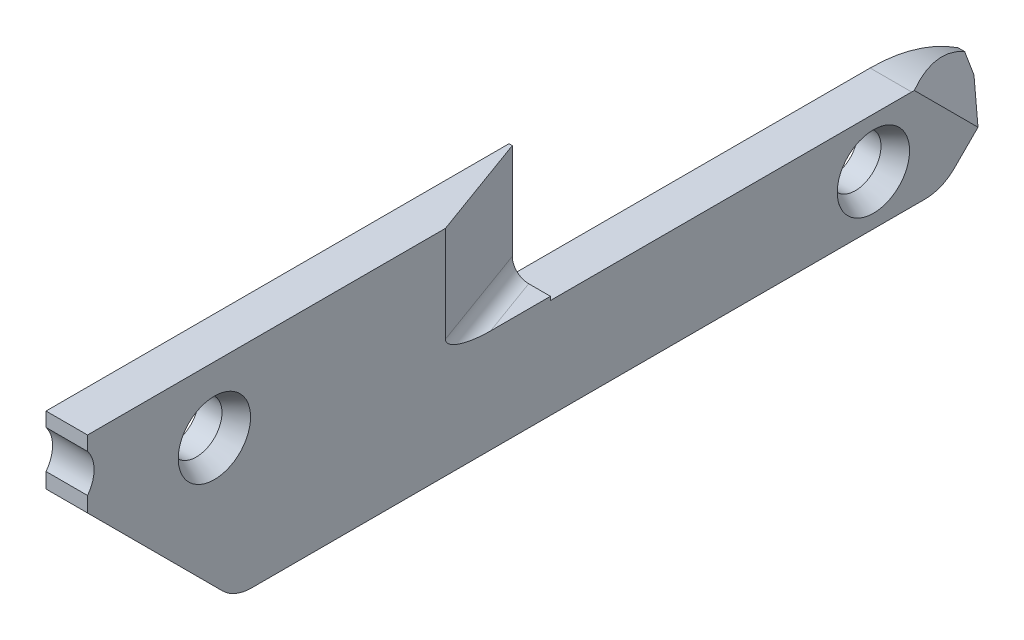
ISO-10303-21;
HEADER;
FILE_DESCRIPTION(('STEP AP214'),'2;1');
FILE_NAME('part.step','',(''),(''),'','','');
FILE_SCHEMA(('AUTOMOTIVE_DESIGN { 1 0 10303 214 1 1 1 1 }'));
ENDSEC;
DATA;
#1=APPLICATION_CONTEXT('core data for automotive mechanical design processes');
#2=APPLICATION_PROTOCOL_DEFINITION('international standard','automotive_design',2000,#1);
#3=PRODUCT_CONTEXT('',#1,'mechanical');
#4=PRODUCT('Part','Part','',(#3));
#5=PRODUCT_RELATED_PRODUCT_CATEGORY('part','',(#4));
#6=PRODUCT_DEFINITION_FORMATION('','',#4);
#7=PRODUCT_DEFINITION_CONTEXT('part definition',#1,'design');
#8=PRODUCT_DEFINITION('design','',#6,#7);
#9=PRODUCT_DEFINITION_SHAPE('','',#8);
#10=(LENGTH_UNIT() NAMED_UNIT(*) SI_UNIT(.MILLI.,.METRE.));
#11=(NAMED_UNIT(*) PLANE_ANGLE_UNIT() SI_UNIT($,.RADIAN.));
#12=(NAMED_UNIT(*) SI_UNIT($,.STERADIAN.) SOLID_ANGLE_UNIT());
#13=UNCERTAINTY_MEASURE_WITH_UNIT(LENGTH_MEASURE(1.E-05),#10,'distance_accuracy_value','');
#14=(GEOMETRIC_REPRESENTATION_CONTEXT(3) GLOBAL_UNCERTAINTY_ASSIGNED_CONTEXT((#13)) GLOBAL_UNIT_ASSIGNED_CONTEXT((#10,
#11,#12)) REPRESENTATION_CONTEXT('',''));
#15=CARTESIAN_POINT('',(0.,0.,0.));
#16=DIRECTION('',(0.,0.,1.));
#17=DIRECTION('',(1.,0.,0.));
#18=AXIS2_PLACEMENT_3D('',#15,#16,#17);
#19=CARTESIAN_POINT('',(3.2004,-16.0782,-53.7464));
#20=DIRECTION('',(1.,0.,0.));
#21=DIRECTION('',(0.,0.,-1.));
#22=AXIS2_PLACEMENT_3D('',#19,#20,#21);
#23=PLANE('',#22);
#24=CARTESIAN_POINT('',(3.2004,-7.62,-50.8));
#25=DIRECTION('',(1.,0.,0.));
#26=DIRECTION('',(0.,0.,-1.));
#27=AXIS2_PLACEMENT_3D('',#24,#25,#26);
#28=CIRCLE('',#27,2.7877583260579);
#29=CARTESIAN_POINT('',(3.2004,-7.62,-53.5877583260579));
#30=VERTEX_POINT('',#29);
#31=EDGE_CURVE('E45',#30,#30,#28,.F.);
#32=ORIENTED_EDGE('',*,*,#31,.T.);
#33=EDGE_LOOP('',(#32));
#34=FACE_BOUND('',#33,.T.);
#35=CARTESIAN_POINT('',(3.2004,0.,0.));
#36=DIRECTION('',(1.,0.,0.));
#37=DIRECTION('',(0.,0.,-1.));
#38=AXIS2_PLACEMENT_3D('',#35,#36,#37);
#39=CIRCLE('',#38,2.7877583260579);
#40=CARTESIAN_POINT('',(3.2004,0.,-2.7877583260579));
#41=VERTEX_POINT('',#40);
#42=EDGE_CURVE('E279',#41,#41,#39,.F.);
#43=ORIENTED_EDGE('',*,*,#42,.T.);
#44=EDGE_LOOP('',(#43));
#45=FACE_BOUND('',#44,.T.);
#46=DIRECTION('',(0.,0.,1.));
#47=VECTOR('',#46,1.);
#48=CARTESIAN_POINT('',(3.2004,-3.5052,-17.8128325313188));
#49=LINE('',#48,#47);
#50=CARTESIAN_POINT('',(3.2004,-3.5052,-25.908));
#51=VERTEX_POINT('',#50);
#52=CARTESIAN_POINT('',(3.2004,-3.5052,-21.293987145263));
#53=VERTEX_POINT('',#52);
#54=EDGE_CURVE('E322',#51,#53,#49,.T.);
#55=ORIENTED_EDGE('',*,*,#54,.T.);
#56=CARTESIAN_POINT('',(3.2004,-2.314575,-21.293987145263));
#57=DIRECTION('',(1.,0.,0.));
#58=DIRECTION('',(0.,0.,-1.));
#59=AXIS2_PLACEMENT_3D('',#56,#57,#58);
#60=ELLIPSE('',#59,3.48115461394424,1.190625);
#61=CARTESIAN_POINT('',(3.2004,-2.314575,-17.8128325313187));
#62=VERTEX_POINT('',#61);
#63=EDGE_CURVE('E162',#53,#62,#60,.F.);
#64=ORIENTED_EDGE('',*,*,#63,.T.);
#65=DIRECTION('',(0.,1.,0.));
#66=VECTOR('',#65,1.);
#67=CARTESIAN_POINT('',(3.2004,-20.0700972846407,-17.8128325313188));
#68=LINE('',#67,#66);
#69=CARTESIAN_POINT('',(3.2004,5.08,-17.8128325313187));
#70=VERTEX_POINT('',#69);
#71=EDGE_CURVE('E156',#62,#70,#68,.T.);
#72=ORIENTED_EDGE('',*,*,#71,.T.);
#73=DIRECTION('',(0.,0.,1.));
#74=VECTOR('',#73,1.);
#75=CARTESIAN_POINT('',(3.2004,5.08,-25.908));
#76=LINE('',#75,#74);
#77=CARTESIAN_POINT('',(3.2004,5.07999999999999,9.779));
#78=VERTEX_POINT('',#77);
#79=EDGE_CURVE('E159',#70,#78,#76,.T.);
#80=ORIENTED_EDGE('',*,*,#79,.T.);
#81=DIRECTION('',(0.,-1.,0.));
#82=VECTOR('',#81,1.);
#83=CARTESIAN_POINT('',(3.2004,5.07999999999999,9.779));
#84=LINE('',#83,#82);
#85=CARTESIAN_POINT('',(3.2004,3.98473128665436,9.779));
#86=VERTEX_POINT('',#85);
#87=EDGE_CURVE('E178',#78,#86,#84,.T.);
#88=ORIENTED_EDGE('',*,*,#87,.T.);
#89=CARTESIAN_POINT('',(3.2004,2.5146,11.65225));
#90=DIRECTION('',(-1.,0.,0.));
#91=DIRECTION('',(0.,0.,-1.));
#92=AXIS2_PLACEMENT_3D('',#89,#90,#91);
#93=CIRCLE('',#92,2.38125);
#94=CARTESIAN_POINT('',(3.2004,1.04446871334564,9.779));
#95=VERTEX_POINT('',#94);
#96=EDGE_CURVE('E181',#86,#95,#93,.T.);
#97=ORIENTED_EDGE('',*,*,#96,.T.);
#98=DIRECTION('',(0.,-1.,0.));
#99=VECTOR('',#98,1.);
#100=CARTESIAN_POINT('',(3.2004,1.04446871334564,9.779));
#101=LINE('',#100,#99);
#102=CARTESIAN_POINT('',(3.2004,-0.127,9.779));
#103=VERTEX_POINT('',#102);
#104=EDGE_CURVE('E189',#95,#103,#101,.T.);
#105=ORIENTED_EDGE('',*,*,#104,.T.);
#106=DIRECTION('',(0.,-0.707106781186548,-0.707106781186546));
#107=VECTOR('',#106,1.);
#108=CARTESIAN_POINT('',(3.2004,-0.127,9.779));
#109=LINE('',#108,#107);
#110=CARTESIAN_POINT('',(3.2004,-10.5254640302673,-0.619464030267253));
#111=VERTEX_POINT('',#110);
#112=EDGE_CURVE('E191',#103,#111,#109,.T.);
#113=ORIENTED_EDGE('',*,*,#112,.T.);
#114=CARTESIAN_POINT('',(3.2004,-8.2804,-2.86452806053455));
#115=DIRECTION('',(1.,0.,0.));
#116=DIRECTION('',(0.,0.,-1.));
#117=AXIS2_PLACEMENT_3D('',#114,#115,#116);
#118=CIRCLE('',#117,3.175);
#119=CARTESIAN_POINT('',(3.2004,-11.4554,-2.86452806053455));
#120=VERTEX_POINT('',#119);
#121=EDGE_CURVE('E193',#111,#120,#118,.T.);
#122=ORIENTED_EDGE('',*,*,#121,.T.);
#123=DIRECTION('',(0.,0.,-1.));
#124=VECTOR('',#123,1.);
#125=CARTESIAN_POINT('',(3.2004,-11.4554,-2.86452806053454));
#126=LINE('',#125,#124);
#127=CARTESIAN_POINT('',(3.2004,-11.4554,-54.7878));
#128=VERTEX_POINT('',#127);
#129=EDGE_CURVE('E195',#120,#128,#126,.T.);
#130=ORIENTED_EDGE('',*,*,#129,.T.);
#131=CARTESIAN_POINT('',(3.2004,-8.2804,-54.7878));
#132=DIRECTION('',(1.,0.,0.));
#133=DIRECTION('',(0.,0.,-1.));
#134=AXIS2_PLACEMENT_3D('',#131,#132,#133);
#135=CIRCLE('',#134,3.175);
#136=CARTESIAN_POINT('',(3.2004,-10.5254640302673,-57.0328640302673));
#137=VERTEX_POINT('',#136);
#138=EDGE_CURVE('E197',#128,#137,#135,.T.);
#139=ORIENTED_EDGE('',*,*,#138,.T.);
#140=DIRECTION('',(0.,0.707106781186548,-0.707106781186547));
#141=VECTOR('',#140,1.);
#142=CARTESIAN_POINT('',(3.2004,-10.5254640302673,-57.0328640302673));
#143=LINE('',#142,#141);
#144=CARTESIAN_POINT('',(3.2004,-8.6961567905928,-58.8621712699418));
#145=VERTEX_POINT('',#144);
#146=EDGE_CURVE('E199',#137,#145,#143,.T.);
#147=ORIENTED_EDGE('',*,*,#146,.T.);
#148=DIRECTION('',(0.,-0.707106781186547,-0.707106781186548));
#149=VECTOR('',#148,1.);
#150=CARTESIAN_POINT('',(3.2004,32.5125072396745,-17.6535072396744));
#151=LINE('',#150,#149);
#152=CARTESIAN_POINT('',(3.2004,-3.78632504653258,-53.9523395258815));
#153=VERTEX_POINT('',#152);
#154=EDGE_CURVE('E307',#153,#145,#151,.T.);
#155=ORIENTED_EDGE('',*,*,#154,.F.);
#156=CARTESIAN_POINT('',(3.2004,-16.0782,-53.7464));
#157=DIRECTION('',(1.,0.,0.));
#158=DIRECTION('',(0.,0.,-1.));
#159=AXIS2_PLACEMENT_3D('',#156,#157,#158);
#160=CIRCLE('',#159,12.2936);
#161=CARTESIAN_POINT('',(3.2004,-3.7846,-53.7464));
#162=VERTEX_POINT('',#161);
#163=EDGE_CURVE('E234',#153,#162,#160,.T.);
#164=ORIENTED_EDGE('',*,*,#163,.T.);
#165=DIRECTION('',(0.,0.,1.));
#166=VECTOR('',#165,1.);
#167=CARTESIAN_POINT('',(3.2004,-3.7846,-53.7464));
#168=LINE('',#167,#166);
#169=CARTESIAN_POINT('',(3.2004,-3.7846,-25.908));
#170=VERTEX_POINT('',#169);
#171=EDGE_CURVE('E184',#162,#170,#168,.T.);
#172=ORIENTED_EDGE('',*,*,#171,.T.);
#173=DIRECTION('',(0.,1.,0.));
#174=VECTOR('',#173,1.);
#175=CARTESIAN_POINT('',(3.2004,-3.7846,-25.908));
#176=LINE('',#175,#174);
#177=EDGE_CURVE('E179',#170,#51,#176,.T.);
#178=ORIENTED_EDGE('',*,*,#177,.T.);
#179=EDGE_LOOP('',(#55,#64,#72,#80,#88,#97,#105,#113,#122,#130,#139,#147,#155,#164,#172,#178));
#180=FACE_BOUND('',#179,.T.);
#181=ADVANCED_FACE('F37',(#34,#45,#180),#23,.T.);
#182=CARTESIAN_POINT('',(0.,-16.0782,-53.7464));
#183=DIRECTION('',(1.,0.,0.));
#184=DIRECTION('',(0.,0.,-1.));
#185=AXIS2_PLACEMENT_3D('',#182,#183,#184);
#186=PLANE('',#185);
#187=CARTESIAN_POINT('',(0.,0.,0.));
#188=DIRECTION('',(1.,0.,0.));
#189=DIRECTION('',(0.,0.,-1.));
#190=AXIS2_PLACEMENT_3D('',#187,#188,#189);
#191=CIRCLE('',#190,1.9812);
#192=CARTESIAN_POINT('',(0.,0.,-1.9812));
#193=VERTEX_POINT('',#192);
#194=EDGE_CURVE('E207',#193,#193,#191,.T.);
#195=ORIENTED_EDGE('',*,*,#194,.T.);
#196=EDGE_LOOP('',(#195));
#197=FACE_BOUND('',#196,.T.);
#198=CARTESIAN_POINT('',(0.,-16.0782,-53.7464));
#199=DIRECTION('',(1.,0.,0.));
#200=DIRECTION('',(0.,0.,-1.));
#201=AXIS2_PLACEMENT_3D('',#198,#199,#200);
#202=CIRCLE('',#201,12.2936);
#203=CARTESIAN_POINT('',(0.,-5.82443046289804,-60.5282));
#204=VERTEX_POINT('',#203);
#205=CARTESIAN_POINT('',(0.,-3.7846,-53.7464));
#206=VERTEX_POINT('',#205);
#207=EDGE_CURVE('E203',#204,#206,#202,.T.);
#208=ORIENTED_EDGE('',*,*,#207,.F.);
#209=DIRECTION('',(0.,1.,0.));
#210=VECTOR('',#209,1.);
#211=CARTESIAN_POINT('',(0.,-7.03012806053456,-60.5282));
#212=LINE('',#211,#210);
#213=CARTESIAN_POINT('',(0.,-7.03012806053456,-60.5282));
#214=VERTEX_POINT('',#213);
#215=EDGE_CURVE('E231',#214,#204,#212,.T.);
#216=ORIENTED_EDGE('',*,*,#215,.F.);
#217=DIRECTION('',(0.,0.707106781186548,-0.707106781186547));
#218=VECTOR('',#217,1.);
#219=CARTESIAN_POINT('',(0.,-10.5254640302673,-57.0328640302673));
#220=LINE('',#219,#218);
#221=CARTESIAN_POINT('',(0.,-10.5254640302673,-57.0328640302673));
#222=VERTEX_POINT('',#221);
#223=EDGE_CURVE('E228',#222,#214,#220,.T.);
#224=ORIENTED_EDGE('',*,*,#223,.F.);
#225=CARTESIAN_POINT('',(0.,-8.2804,-54.7878));
#226=DIRECTION('',(1.,0.,0.));
#227=DIRECTION('',(0.,0.,-1.));
#228=AXIS2_PLACEMENT_3D('',#225,#226,#227);
#229=CIRCLE('',#228,3.175);
#230=CARTESIAN_POINT('',(0.,-11.4554,-54.7878));
#231=VERTEX_POINT('',#230);
#232=EDGE_CURVE('E226',#231,#222,#229,.T.);
#233=ORIENTED_EDGE('',*,*,#232,.F.);
#234=DIRECTION('',(0.,0.,-1.));
#235=VECTOR('',#234,1.);
#236=CARTESIAN_POINT('',(0.,-11.4554,-2.86452806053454));
#237=LINE('',#236,#235);
#238=CARTESIAN_POINT('',(0.,-11.4554,-2.86452806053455));
#239=VERTEX_POINT('',#238);
#240=EDGE_CURVE('E224',#239,#231,#237,.T.);
#241=ORIENTED_EDGE('',*,*,#240,.F.);
#242=CARTESIAN_POINT('',(0.,-8.2804,-2.86452806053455));
#243=DIRECTION('',(1.,0.,0.));
#244=DIRECTION('',(0.,0.,-1.));
#245=AXIS2_PLACEMENT_3D('',#242,#243,#244);
#246=CIRCLE('',#245,3.175);
#247=CARTESIAN_POINT('',(0.,-10.5254640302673,-0.619464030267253));
#248=VERTEX_POINT('',#247);
#249=EDGE_CURVE('E222',#248,#239,#246,.T.);
#250=ORIENTED_EDGE('',*,*,#249,.F.);
#251=DIRECTION('',(0.,-0.707106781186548,-0.707106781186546));
#252=VECTOR('',#251,1.);
#253=CARTESIAN_POINT('',(0.,-0.127,9.779));
#254=LINE('',#253,#252);
#255=CARTESIAN_POINT('',(0.,-0.127,9.779));
#256=VERTEX_POINT('',#255);
#257=EDGE_CURVE('E220',#256,#248,#254,.T.);
#258=ORIENTED_EDGE('',*,*,#257,.F.);
#259=DIRECTION('',(0.,-1.,0.));
#260=VECTOR('',#259,1.);
#261=CARTESIAN_POINT('',(0.,1.04446871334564,9.779));
#262=LINE('',#261,#260);
#263=CARTESIAN_POINT('',(0.,1.04446871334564,9.779));
#264=VERTEX_POINT('',#263);
#265=EDGE_CURVE('E218',#264,#256,#262,.T.);
#266=ORIENTED_EDGE('',*,*,#265,.F.);
#267=CARTESIAN_POINT('',(0.,2.5146,11.65225));
#268=DIRECTION('',(-1.,0.,0.));
#269=DIRECTION('',(0.,0.,-1.));
#270=AXIS2_PLACEMENT_3D('',#267,#268,#269);
#271=CIRCLE('',#270,2.38125);
#272=CARTESIAN_POINT('',(0.,3.98473128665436,9.779));
#273=VERTEX_POINT('',#272);
#274=EDGE_CURVE('E216',#273,#264,#271,.T.);
#275=ORIENTED_EDGE('',*,*,#274,.F.);
#276=DIRECTION('',(0.,-1.,0.));
#277=VECTOR('',#276,1.);
#278=CARTESIAN_POINT('',(0.,5.07999999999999,9.779));
#279=LINE('',#278,#277);
#280=CARTESIAN_POINT('',(0.,5.07999999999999,9.779));
#281=VERTEX_POINT('',#280);
#282=EDGE_CURVE('E214',#281,#273,#279,.T.);
#283=ORIENTED_EDGE('',*,*,#282,.F.);
#284=DIRECTION('',(0.,0.,1.));
#285=VECTOR('',#284,1.);
#286=CARTESIAN_POINT('',(0.,5.08,-25.908));
#287=LINE('',#286,#285);
#288=CARTESIAN_POINT('',(0.,5.08,-25.908));
#289=VERTEX_POINT('',#288);
#290=EDGE_CURVE('E212',#289,#281,#287,.T.);
#291=ORIENTED_EDGE('',*,*,#290,.F.);
#292=DIRECTION('',(0.,1.,0.));
#293=VECTOR('',#292,1.);
#294=CARTESIAN_POINT('',(0.,-3.7846,-25.908));
#295=LINE('',#294,#293);
#296=CARTESIAN_POINT('',(0.,-3.7846,-25.908));
#297=VERTEX_POINT('',#296);
#298=EDGE_CURVE('E209',#297,#289,#295,.T.);
#299=ORIENTED_EDGE('',*,*,#298,.F.);
#300=DIRECTION('',(0.,0.,1.));
#301=VECTOR('',#300,1.);
#302=CARTESIAN_POINT('',(0.,-3.7846,-53.7464));
#303=LINE('',#302,#301);
#304=EDGE_CURVE('E206',#206,#297,#303,.T.);
#305=ORIENTED_EDGE('',*,*,#304,.F.);
#306=EDGE_LOOP('',(#208,#216,#224,#233,#241,#250,#258,#266,#275,#283,#291,#299,#305));
#307=FACE_BOUND('',#306,.T.);
#308=CARTESIAN_POINT('',(0.,-7.62,-50.8));
#309=DIRECTION('',(1.,0.,0.));
#310=DIRECTION('',(0.,0.,-1.));
#311=AXIS2_PLACEMENT_3D('',#308,#309,#310);
#312=CIRCLE('',#311,1.9812);
#313=CARTESIAN_POINT('',(0.,-7.62,-52.7812));
#314=VERTEX_POINT('',#313);
#315=EDGE_CURVE('E300',#314,#314,#312,.T.);
#316=ORIENTED_EDGE('',*,*,#315,.T.);
#317=EDGE_LOOP('',(#316));
#318=FACE_BOUND('',#317,.T.);
#319=ADVANCED_FACE('F346',(#197,#307,#318),#186,.F.);
#320=CARTESIAN_POINT('',(3.2004,-16.0782,-53.7464));
#321=DIRECTION('',(-1.,0.,0.));
#322=DIRECTION('',(0.,0.,1.));
#323=AXIS2_PLACEMENT_3D('',#320,#321,#322);
#324=CYLINDRICAL_SURFACE('',#323,12.2936);
#325=ORIENTED_EDGE('',*,*,#163,.F.);
#326=CARTESIAN_POINT('',(10.6157662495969,-16.0782,-53.7464));
#327=DIRECTION('',(-0.766044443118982,-0.454519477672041,0.45451947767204));
#328=DIRECTION('',(-0.642787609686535,0.541675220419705,-0.541675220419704));
#329=AXIS2_PLACEMENT_3D('',#326,#327,#328);
#330=ELLIPSE('',#329,16.0481550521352,12.2936);
#331=CARTESIAN_POINT('',(0.508000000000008,-5.82443046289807,-60.5282));
#332=VERTEX_POINT('',#331);
#333=EDGE_CURVE('E302',#153,#332,#330,.T.);
#334=ORIENTED_EDGE('',*,*,#333,.T.);
#335=DIRECTION('',(-1.,0.,0.));
#336=VECTOR('',#335,1.);
#337=CARTESIAN_POINT('',(3.2004,-5.82443046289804,-60.5282));
#338=LINE('',#337,#336);
#339=EDGE_CURVE('E202',#332,#204,#338,.T.);
#340=ORIENTED_EDGE('',*,*,#339,.T.);
#341=ORIENTED_EDGE('',*,*,#207,.T.);
#342=DIRECTION('',(-1.,0.,0.));
#343=VECTOR('',#342,1.);
#344=CARTESIAN_POINT('',(3.2004,-3.7846,-53.7464));
#345=LINE('',#344,#343);
#346=EDGE_CURVE('E265',#162,#206,#345,.T.);
#347=ORIENTED_EDGE('',*,*,#346,.F.);
#348=EDGE_LOOP('',(#325,#334,#340,#341,#347));
#349=FACE_BOUND('',#348,.T.);
#350=ADVANCED_FACE('F352',(#349),#324,.T.);
#351=CARTESIAN_POINT('',(3.2004,-3.7846,-53.7464));
#352=DIRECTION('',(0.,-1.,0.));
#353=DIRECTION('',(0.,0.,-1.));
#354=AXIS2_PLACEMENT_3D('',#351,#352,#353);
#355=PLANE('',#354);
#356=ORIENTED_EDGE('',*,*,#304,.T.);
#357=DIRECTION('',(-1.,0.,0.));
#358=VECTOR('',#357,1.);
#359=CARTESIAN_POINT('',(3.2004,-3.7846,-25.908));
#360=LINE('',#359,#358);
#361=EDGE_CURVE('E262',#170,#297,#360,.T.);
#362=ORIENTED_EDGE('',*,*,#361,.F.);
#363=ORIENTED_EDGE('',*,*,#171,.F.);
#364=ORIENTED_EDGE('',*,*,#346,.T.);
#365=EDGE_LOOP('',(#356,#362,#363,#364));
#366=FACE_BOUND('',#365,.T.);
#367=ADVANCED_FACE('F318',(#366),#355,.F.);
#368=CARTESIAN_POINT('',(3.2004,-3.7846,-25.908));
#369=DIRECTION('',(0.,0.,1.));
#370=DIRECTION('',(1.,0.,0.));
#371=AXIS2_PLACEMENT_3D('',#368,#369,#370);
#372=PLANE('',#371);
#373=DIRECTION('',(-1.,0.,0.));
#374=VECTOR('',#373,1.);
#375=CARTESIAN_POINT('',(3.2004,5.08,-25.908));
#376=LINE('',#375,#374);
#377=CARTESIAN_POINT('',(0.254,5.08,-25.908));
#378=VERTEX_POINT('',#377);
#379=EDGE_CURVE('E260',#378,#289,#376,.T.);
#380=ORIENTED_EDGE('',*,*,#379,.F.);
#381=DIRECTION('',(0.,1.,0.));
#382=VECTOR('',#381,1.);
#383=CARTESIAN_POINT('',(0.254,-20.0700972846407,-25.908));
#384=LINE('',#383,#382);
#385=CARTESIAN_POINT('',(0.254,-2.314575,-25.908));
#386=VERTEX_POINT('',#385);
#387=EDGE_CURVE('E166',#386,#378,#384,.T.);
#388=ORIENTED_EDGE('',*,*,#387,.F.);
#389=CARTESIAN_POINT('',(1.52103666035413,-2.314575,-25.908));
#390=DIRECTION('',(0.,0.,1.));
#391=DIRECTION('',(-1.,0.,0.));
#392=AXIS2_PLACEMENT_3D('',#389,#390,#391);
#393=ELLIPSE('',#392,1.26703666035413,1.190625);
#394=CARTESIAN_POINT('',(1.52103666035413,-3.5052,-25.908));
#395=VERTEX_POINT('',#394);
#396=EDGE_CURVE('E52',#386,#395,#393,.T.);
#397=ORIENTED_EDGE('',*,*,#396,.T.);
#398=DIRECTION('',(1.,0.,0.));
#399=VECTOR('',#398,1.);
#400=CARTESIAN_POINT('',(3.2004,-3.5052,-25.908));
#401=LINE('',#400,#399);
#402=EDGE_CURVE('E321',#395,#51,#401,.T.);
#403=ORIENTED_EDGE('',*,*,#402,.T.);
#404=ORIENTED_EDGE('',*,*,#177,.F.);
#405=ORIENTED_EDGE('',*,*,#361,.T.);
#406=ORIENTED_EDGE('',*,*,#298,.T.);
#407=EDGE_LOOP('',(#380,#388,#397,#403,#404,#405,#406));
#408=FACE_BOUND('',#407,.T.);
#409=ADVANCED_FACE('F320',(#408),#372,.F.);
#410=CARTESIAN_POINT('',(3.2004,5.08,-25.908));
#411=DIRECTION('',(0.,-1.,0.));
#412=DIRECTION('',(0.,0.,-1.));
#413=AXIS2_PLACEMENT_3D('',#410,#411,#412);
#414=PLANE('',#413);
#415=ORIENTED_EDGE('',*,*,#79,.F.);
#416=DIRECTION('',(0.342020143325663,0.,0.939692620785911));
#417=VECTOR('',#416,1.);
#418=CARTESIAN_POINT('',(0.254,5.08,-25.908));
#419=LINE('',#418,#417);
#420=EDGE_CURVE('E167',#378,#70,#419,.T.);
#421=ORIENTED_EDGE('',*,*,#420,.F.);
#422=ORIENTED_EDGE('',*,*,#379,.T.);
#423=ORIENTED_EDGE('',*,*,#290,.T.);
#424=DIRECTION('',(-1.,0.,0.));
#425=VECTOR('',#424,1.);
#426=CARTESIAN_POINT('',(3.2004,5.07999999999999,9.779));
#427=LINE('',#426,#425);
#428=EDGE_CURVE('E176',#78,#281,#427,.T.);
#429=ORIENTED_EDGE('',*,*,#428,.F.);
#430=EDGE_LOOP('',(#415,#421,#422,#423,#429));
#431=FACE_BOUND('',#430,.T.);
#432=ADVANCED_FACE('F174',(#431),#414,.F.);
#433=CARTESIAN_POINT('',(3.2004,5.07999999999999,9.779));
#434=DIRECTION('',(0.,0.,-1.));
#435=DIRECTION('',(0.,1.,0.));
#436=AXIS2_PLACEMENT_3D('',#433,#434,#435);
#437=PLANE('',#436);
#438=ORIENTED_EDGE('',*,*,#282,.T.);
#439=DIRECTION('',(-1.,0.,0.));
#440=VECTOR('',#439,1.);
#441=CARTESIAN_POINT('',(3.2004,3.98473128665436,9.779));
#442=LINE('',#441,#440);
#443=EDGE_CURVE('E256',#86,#273,#442,.T.);
#444=ORIENTED_EDGE('',*,*,#443,.F.);
#445=ORIENTED_EDGE('',*,*,#87,.F.);
#446=ORIENTED_EDGE('',*,*,#428,.T.);
#447=EDGE_LOOP('',(#438,#444,#445,#446));
#448=FACE_BOUND('',#447,.T.);
#449=ADVANCED_FACE('F396',(#448),#437,.F.);
#450=CARTESIAN_POINT('',(3.2004,2.5146,11.65225));
#451=DIRECTION('',(-1.,0.,0.));
#452=DIRECTION('',(0.,0.,1.));
#453=AXIS2_PLACEMENT_3D('',#450,#451,#452);
#454=CYLINDRICAL_SURFACE('',#453,2.38125);
#455=ORIENTED_EDGE('',*,*,#274,.T.);
#456=DIRECTION('',(-1.,0.,0.));
#457=VECTOR('',#456,1.);
#458=CARTESIAN_POINT('',(3.2004,1.04446871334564,9.779));
#459=LINE('',#458,#457);
#460=EDGE_CURVE('E253',#95,#264,#459,.T.);
#461=ORIENTED_EDGE('',*,*,#460,.F.);
#462=ORIENTED_EDGE('',*,*,#96,.F.);
#463=ORIENTED_EDGE('',*,*,#443,.T.);
#464=EDGE_LOOP('',(#455,#461,#462,#463));
#465=FACE_BOUND('',#464,.T.);
#466=ADVANCED_FACE('F392',(#465),#454,.F.);
#467=CARTESIAN_POINT('',(3.2004,1.04446871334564,9.779));
#468=DIRECTION('',(0.,0.,-1.));
#469=DIRECTION('',(-1.,0.,0.));
#470=AXIS2_PLACEMENT_3D('',#467,#468,#469);
#471=PLANE('',#470);
#472=ORIENTED_EDGE('',*,*,#265,.T.);
#473=DIRECTION('',(-1.,0.,0.));
#474=VECTOR('',#473,1.);
#475=CARTESIAN_POINT('',(3.2004,-0.127,9.779));
#476=LINE('',#475,#474);
#477=EDGE_CURVE('E250',#103,#256,#476,.T.);
#478=ORIENTED_EDGE('',*,*,#477,.F.);
#479=ORIENTED_EDGE('',*,*,#104,.F.);
#480=ORIENTED_EDGE('',*,*,#460,.T.);
#481=EDGE_LOOP('',(#472,#478,#479,#480));
#482=FACE_BOUND('',#481,.T.);
#483=ADVANCED_FACE('F388',(#482),#471,.F.);
#484=CARTESIAN_POINT('',(3.2004,-0.127,9.779));
#485=DIRECTION('',(0.,0.707106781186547,-0.707106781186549));
#486=DIRECTION('',(0.,0.707106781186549,0.707106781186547));
#487=AXIS2_PLACEMENT_3D('',#484,#485,#486);
#488=PLANE('',#487);
#489=ORIENTED_EDGE('',*,*,#257,.T.);
#490=DIRECTION('',(-1.,0.,0.));
#491=VECTOR('',#490,1.);
#492=CARTESIAN_POINT('',(3.2004,-10.5254640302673,-0.619464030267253));
#493=LINE('',#492,#491);
#494=EDGE_CURVE('E247',#111,#248,#493,.T.);
#495=ORIENTED_EDGE('',*,*,#494,.F.);
#496=ORIENTED_EDGE('',*,*,#112,.F.);
#497=ORIENTED_EDGE('',*,*,#477,.T.);
#498=EDGE_LOOP('',(#489,#495,#496,#497));
#499=FACE_BOUND('',#498,.T.);
#500=ADVANCED_FACE('F384',(#499),#488,.F.);
#501=CARTESIAN_POINT('',(3.2004,-8.2804,-2.86452806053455));
#502=DIRECTION('',(-1.,0.,0.));
#503=DIRECTION('',(0.,0.,1.));
#504=AXIS2_PLACEMENT_3D('',#501,#502,#503);
#505=CYLINDRICAL_SURFACE('',#504,3.175);
#506=ORIENTED_EDGE('',*,*,#249,.T.);
#507=DIRECTION('',(-1.,0.,0.));
#508=VECTOR('',#507,1.);
#509=CARTESIAN_POINT('',(3.2004,-11.4554,-2.86452806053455));
#510=LINE('',#509,#508);
#511=EDGE_CURVE('E244',#120,#239,#510,.T.);
#512=ORIENTED_EDGE('',*,*,#511,.F.);
#513=ORIENTED_EDGE('',*,*,#121,.F.);
#514=ORIENTED_EDGE('',*,*,#494,.T.);
#515=EDGE_LOOP('',(#506,#512,#513,#514));
#516=FACE_BOUND('',#515,.T.);
#517=ADVANCED_FACE('F380',(#516),#505,.T.);
#518=CARTESIAN_POINT('',(3.2004,-11.4554,-2.86452806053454));
#519=DIRECTION('',(0.,1.,0.));
#520=DIRECTION('',(0.,0.,1.));
#521=AXIS2_PLACEMENT_3D('',#518,#519,#520);
#522=PLANE('',#521);
#523=ORIENTED_EDGE('',*,*,#240,.T.);
#524=DIRECTION('',(-1.,0.,0.));
#525=VECTOR('',#524,1.);
#526=CARTESIAN_POINT('',(3.2004,-11.4554,-54.7878));
#527=LINE('',#526,#525);
#528=EDGE_CURVE('E241',#128,#231,#527,.T.);
#529=ORIENTED_EDGE('',*,*,#528,.F.);
#530=ORIENTED_EDGE('',*,*,#129,.F.);
#531=ORIENTED_EDGE('',*,*,#511,.T.);
#532=EDGE_LOOP('',(#523,#529,#530,#531));
#533=FACE_BOUND('',#532,.T.);
#534=ADVANCED_FACE('F377',(#533),#522,.F.);
#535=CARTESIAN_POINT('',(3.2004,-8.2804,-54.7878));
#536=DIRECTION('',(-1.,0.,0.));
#537=DIRECTION('',(0.,0.,1.));
#538=AXIS2_PLACEMENT_3D('',#535,#536,#537);
#539=CYLINDRICAL_SURFACE('',#538,3.175);
#540=ORIENTED_EDGE('',*,*,#232,.T.);
#541=DIRECTION('',(-1.,0.,0.));
#542=VECTOR('',#541,1.);
#543=CARTESIAN_POINT('',(3.2004,-10.5254640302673,-57.0328640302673));
#544=LINE('',#543,#542);
#545=EDGE_CURVE('E238',#137,#222,#544,.T.);
#546=ORIENTED_EDGE('',*,*,#545,.F.);
#547=ORIENTED_EDGE('',*,*,#138,.F.);
#548=ORIENTED_EDGE('',*,*,#528,.T.);
#549=EDGE_LOOP('',(#540,#546,#547,#548));
#550=FACE_BOUND('',#549,.T.);
#551=ADVANCED_FACE('F340',(#550),#539,.T.);
#552=CARTESIAN_POINT('',(3.2004,-10.5254640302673,-57.0328640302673));
#553=DIRECTION('',(0.,0.707106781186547,0.707106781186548));
#554=DIRECTION('',(0.,-0.707106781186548,0.707106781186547));
#555=AXIS2_PLACEMENT_3D('',#552,#553,#554);
#556=PLANE('',#555);
#557=DIRECTION('',(-1.,0.,0.));
#558=VECTOR('',#557,1.);
#559=CARTESIAN_POINT('',(3.2004,-7.03012806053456,-60.5282));
#560=LINE('',#559,#558);
#561=CARTESIAN_POINT('',(1.22338022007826,-7.03012806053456,-60.5282));
#562=VERTEX_POINT('',#561);
#563=EDGE_CURVE('E236',#562,#214,#560,.T.);
#564=ORIENTED_EDGE('',*,*,#563,.F.);
#565=DIRECTION('',(-0.642787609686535,0.541675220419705,-0.541675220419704));
#566=VECTOR('',#565,1.);
#567=CARTESIAN_POINT('',(3.2004,-8.6961567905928,-58.8621712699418));
#568=LINE('',#567,#566);
#569=EDGE_CURVE('E325',#145,#562,#568,.T.);
#570=ORIENTED_EDGE('',*,*,#569,.F.);
#571=ORIENTED_EDGE('',*,*,#146,.F.);
#572=ORIENTED_EDGE('',*,*,#545,.T.);
#573=ORIENTED_EDGE('',*,*,#223,.T.);
#574=EDGE_LOOP('',(#564,#570,#571,#572,#573));
#575=FACE_BOUND('',#574,.T.);
#576=ADVANCED_FACE('F334',(#575),#556,.F.);
#577=CARTESIAN_POINT('',(3.2004,-7.03012806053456,-60.5282));
#578=DIRECTION('',(0.,0.,1.));
#579=DIRECTION('',(1.,0.,0.));
#580=AXIS2_PLACEMENT_3D('',#577,#578,#579);
#581=PLANE('',#580);
#582=ORIENTED_EDGE('',*,*,#339,.F.);
#583=DIRECTION('',(0.510273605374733,-0.860012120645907,0.));
#584=VECTOR('',#583,1.);
#585=CARTESIAN_POINT('',(1.73815495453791,-7.89772635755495,-60.5282));
#586=LINE('',#585,#584);
#587=EDGE_CURVE('E268',#332,#562,#586,.T.);
#588=ORIENTED_EDGE('',*,*,#587,.T.);
#589=ORIENTED_EDGE('',*,*,#563,.T.);
#590=ORIENTED_EDGE('',*,*,#215,.T.);
#591=EDGE_LOOP('',(#582,#588,#589,#590));
#592=FACE_BOUND('',#591,.T.);
#593=ADVANCED_FACE('F350',(#592),#581,.F.);
#594=CARTESIAN_POINT('',(3.2004,0.,0.));
#595=DIRECTION('',(-1.,0.,0.));
#596=DIRECTION('',(0.,0.,1.));
#597=AXIS2_PLACEMENT_3D('',#594,#595,#596);
#598=CYLINDRICAL_SURFACE('',#597,1.9812);
#599=CARTESIAN_POINT('',(1.80340000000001,0.,0.));
#600=DIRECTION('',(1.,0.,0.));
#601=DIRECTION('',(0.,0.,-1.));
#602=AXIS2_PLACEMENT_3D('',#599,#600,#601);
#603=CIRCLE('',#602,1.9812);
#604=CARTESIAN_POINT('',(1.80340000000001,0.,-1.9812));
#605=VERTEX_POINT('',#604);
#606=EDGE_CURVE('E12',#605,#605,#603,.T.);
#607=ORIENTED_EDGE('',*,*,#606,.T.);
#608=EDGE_LOOP('',(#607));
#609=FACE_BOUND('',#608,.T.);
#610=ORIENTED_EDGE('',*,*,#194,.F.);
#611=EDGE_LOOP('',(#610));
#612=FACE_BOUND('',#611,.T.);
#613=ADVANCED_FACE('F296',(#609,#612),#598,.F.);
#614=CARTESIAN_POINT('',(3.2004,-7.62,-50.8));
#615=DIRECTION('',(-1.,0.,0.));
#616=DIRECTION('',(0.,0.,1.));
#617=AXIS2_PLACEMENT_3D('',#614,#615,#616);
#618=CYLINDRICAL_SURFACE('',#617,1.9812);
#619=CARTESIAN_POINT('',(1.80340000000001,-7.62,-50.8));
#620=DIRECTION('',(1.,0.,0.));
#621=DIRECTION('',(0.,0.,-1.));
#622=AXIS2_PLACEMENT_3D('',#619,#620,#621);
#623=CIRCLE('',#622,1.9812);
#624=CARTESIAN_POINT('',(1.80340000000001,-7.62,-52.7812));
#625=VERTEX_POINT('',#624);
#626=EDGE_CURVE('E276',#625,#625,#623,.T.);
#627=ORIENTED_EDGE('',*,*,#626,.T.);
#628=EDGE_LOOP('',(#627));
#629=FACE_BOUND('',#628,.T.);
#630=ORIENTED_EDGE('',*,*,#315,.F.);
#631=EDGE_LOOP('',(#630));
#632=FACE_BOUND('',#631,.T.);
#633=ADVANCED_FACE('F292',(#629,#632),#618,.F.);
#634=CARTESIAN_POINT('',(3.2004,32.5125072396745,-17.6535072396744));
#635=DIRECTION('',(-0.766044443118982,-0.454519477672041,0.45451947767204));
#636=DIRECTION('',(0.510273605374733,-0.860012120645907,0.));
#637=AXIS2_PLACEMENT_3D('',#634,#635,#636);
#638=PLANE('',#637);
#639=ORIENTED_EDGE('',*,*,#154,.T.);
#640=ORIENTED_EDGE('',*,*,#569,.T.);
#641=ORIENTED_EDGE('',*,*,#587,.F.);
#642=ORIENTED_EDGE('',*,*,#333,.F.);
#643=EDGE_LOOP('',(#639,#640,#641,#642));
#644=FACE_BOUND('',#643,.T.);
#645=ADVANCED_FACE('F295',(#644),#638,.F.);
#646=CARTESIAN_POINT('',(0.254,-20.0700972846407,-25.908));
#647=DIRECTION('',(-0.93969262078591,0.,0.342020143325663));
#648=DIRECTION('',(0.342020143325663,0.,0.939692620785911));
#649=AXIS2_PLACEMENT_3D('',#646,#647,#648);
#650=PLANE('',#649);
#651=ORIENTED_EDGE('',*,*,#71,.F.);
#652=DIRECTION('',(-0.342020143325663,0.,-0.939692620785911));
#653=VECTOR('',#652,1.);
#654=CARTESIAN_POINT('',(0.253999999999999,-2.314575,-25.908));
#655=LINE('',#654,#653);
#656=EDGE_CURVE('E271',#62,#386,#655,.T.);
#657=ORIENTED_EDGE('',*,*,#656,.T.);
#658=ORIENTED_EDGE('',*,*,#387,.T.);
#659=ORIENTED_EDGE('',*,*,#420,.T.);
#660=EDGE_LOOP('',(#651,#657,#658,#659));
#661=FACE_BOUND('',#660,.T.);
#662=ADVANCED_FACE('F170',(#661),#650,.F.);
#663=CARTESIAN_POINT('',(3.2004,-3.5052,-2.86452806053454));
#664=DIRECTION('',(0.,1.,0.));
#665=DIRECTION('',(0.,0.,1.));
#666=AXIS2_PLACEMENT_3D('',#663,#664,#665);
#667=PLANE('',#666);
#668=ORIENTED_EDGE('',*,*,#402,.F.);
#669=DIRECTION('',(-0.342020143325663,0.,-0.939692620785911));
#670=VECTOR('',#669,1.);
#671=CARTESIAN_POINT('',(9.12351397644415,-3.5052,-5.02036524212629));
#672=LINE('',#671,#670);
#673=EDGE_CURVE('E59',#395,#53,#672,.F.);
#674=ORIENTED_EDGE('',*,*,#673,.T.);
#675=ORIENTED_EDGE('',*,*,#54,.F.);
#676=EDGE_LOOP('',(#668,#674,#675));
#677=FACE_BOUND('',#676,.T.);
#678=ADVANCED_FACE('F324',(#677),#667,.T.);
#679=CARTESIAN_POINT('',(1.37282152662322,-2.314575,-26.3152177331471));
#680=DIRECTION('',(-0.342020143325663,0.,-0.939692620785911));
#681=DIRECTION('',(-0.939692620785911,0.,0.342020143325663));
#682=AXIS2_PLACEMENT_3D('',#679,#680,#681);
#683=CYLINDRICAL_SURFACE('',#682,1.190625);
#684=ORIENTED_EDGE('',*,*,#63,.F.);
#685=ORIENTED_EDGE('',*,*,#673,.F.);
#686=ORIENTED_EDGE('',*,*,#396,.F.);
#687=ORIENTED_EDGE('',*,*,#656,.F.);
#688=EDGE_LOOP('',(#684,#685,#686,#687));
#689=FACE_BOUND('',#688,.T.);
#690=ADVANCED_FACE('F289',(#689),#683,.F.);
#691=CARTESIAN_POINT('',(1.80340000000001,-7.62,-50.8));
#692=DIRECTION('',(1.,0.,0.));
#693=DIRECTION('',(0.,0.,-1.));
#694=AXIS2_PLACEMENT_3D('',#691,#692,#693);
#695=CONICAL_SURFACE('',#694,1.9812,0.523598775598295);
#696=ORIENTED_EDGE('',*,*,#31,.F.);
#697=EDGE_LOOP('',(#696));
#698=FACE_BOUND('',#697,.T.);
#699=ORIENTED_EDGE('',*,*,#626,.F.);
#700=EDGE_LOOP('',(#699));
#701=FACE_BOUND('',#700,.T.);
#702=ADVANCED_FACE('F286',(#698,#701),#695,.F.);
#703=CARTESIAN_POINT('',(1.80340000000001,0.,0.));
#704=DIRECTION('',(1.,0.,0.));
#705=DIRECTION('',(0.,0.,-1.));
#706=AXIS2_PLACEMENT_3D('',#703,#704,#705);
#707=CONICAL_SURFACE('',#706,1.9812,0.523598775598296);
#708=ORIENTED_EDGE('',*,*,#42,.F.);
#709=EDGE_LOOP('',(#708));
#710=FACE_BOUND('',#709,.T.);
#711=ORIENTED_EDGE('',*,*,#606,.F.);
#712=EDGE_LOOP('',(#711));
#713=FACE_BOUND('',#712,.T.);
#714=ADVANCED_FACE('F39',(#710,#713),#707,.F.);
#715=CLOSED_SHELL('',(#181,#319,#350,#367,#409,#432,#449,#466,#483,#500,#517,#534,#551,#576,
#593,#613,#633,#645,#662,#678,#690,#702,#714));
#716=MANIFOLD_SOLID_BREP('B2',#715);
#717=ADVANCED_BREP_SHAPE_REPRESENTATION('',(#18,#716),#14);
#718=SHAPE_DEFINITION_REPRESENTATION(#9,#717);
ENDSEC;
END-ISO-10303-21;
